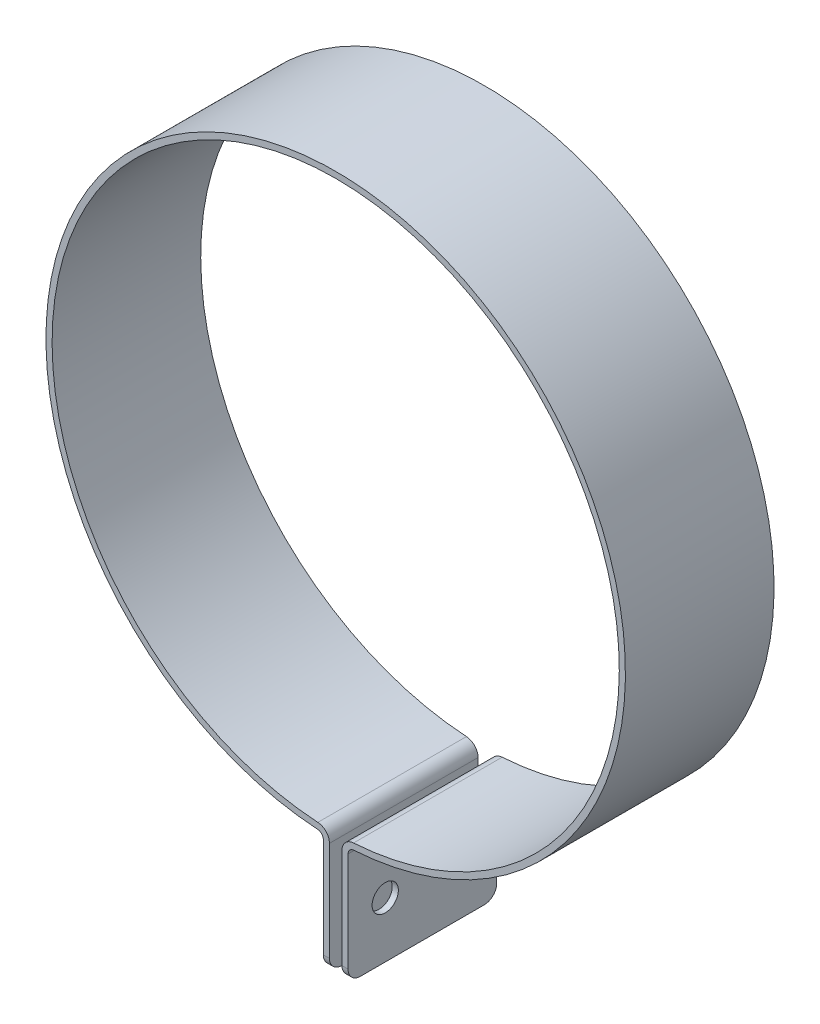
ISO-10303-21;
HEADER;
FILE_DESCRIPTION(('STEP AP214'),'2;1');
FILE_NAME('part.step','',(''),(''),'','','');
FILE_SCHEMA(('AUTOMOTIVE_DESIGN { 1 0 10303 214 1 1 1 1 }'));
ENDSEC;
DATA;
#1=APPLICATION_CONTEXT('core data for automotive mechanical design processes');
#2=APPLICATION_PROTOCOL_DEFINITION('international standard','automotive_design',2000,#1);
#3=PRODUCT_CONTEXT('',#1,'mechanical');
#4=PRODUCT('Part','Part','',(#3));
#5=PRODUCT_RELATED_PRODUCT_CATEGORY('part','',(#4));
#6=PRODUCT_DEFINITION_FORMATION('','',#4);
#7=PRODUCT_DEFINITION_CONTEXT('part definition',#1,'design');
#8=PRODUCT_DEFINITION('design','',#6,#7);
#9=PRODUCT_DEFINITION_SHAPE('','',#8);
#10=(LENGTH_UNIT() NAMED_UNIT(*) SI_UNIT(.MILLI.,.METRE.));
#11=(NAMED_UNIT(*) PLANE_ANGLE_UNIT() SI_UNIT($,.RADIAN.));
#12=(NAMED_UNIT(*) SI_UNIT($,.STERADIAN.) SOLID_ANGLE_UNIT());
#13=UNCERTAINTY_MEASURE_WITH_UNIT(LENGTH_MEASURE(1.E-05),#10,'distance_accuracy_value','');
#14=(GEOMETRIC_REPRESENTATION_CONTEXT(3) GLOBAL_UNCERTAINTY_ASSIGNED_CONTEXT((#13)) GLOBAL_UNIT_ASSIGNED_CONTEXT((#10,
#11,#12)) REPRESENTATION_CONTEXT('',''));
#15=CARTESIAN_POINT('',(0.,0.,0.));
#16=DIRECTION('',(0.,0.,1.));
#17=DIRECTION('',(1.,0.,0.));
#18=AXIS2_PLACEMENT_3D('',#15,#16,#17);
#19=CARTESIAN_POINT('',(-3.175,-104.4575,-38.1));
#20=DIRECTION('',(0.,-1.,0.));
#21=DIRECTION('',(0.,0.,-1.));
#22=AXIS2_PLACEMENT_3D('',#19,#20,#21);
#23=PLANE('',#22);
#24=DIRECTION('',(0.,0.,1.));
#25=VECTOR('',#24,1.);
#26=CARTESIAN_POINT('',(-3.175,-104.4575,-38.1));
#27=LINE('',#26,#25);
#28=CARTESIAN_POINT('',(-3.175,-104.4575,-34.925));
#29=VERTEX_POINT('',#28);
#30=CARTESIAN_POINT('',(-3.175,-104.4575,-3.17500000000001));
#31=VERTEX_POINT('',#30);
#32=EDGE_CURVE('E284',#29,#31,#27,.T.);
#33=ORIENTED_EDGE('',*,*,#32,.F.);
#34=DIRECTION('',(1.,0.,0.));
#35=VECTOR('',#34,1.);
#36=CARTESIAN_POINT('',(-1.6002,-104.4575,-34.925));
#37=LINE('',#36,#35);
#38=CARTESIAN_POINT('',(-1.6002,-104.4575,-34.925));
#39=VERTEX_POINT('',#38);
#40=EDGE_CURVE('E226',#29,#39,#37,.T.);
#41=ORIENTED_EDGE('',*,*,#40,.T.);
#42=DIRECTION('',(0.,0.,-1.));
#43=VECTOR('',#42,1.);
#44=CARTESIAN_POINT('',(-1.6002,-104.4575,-38.1));
#45=LINE('',#44,#43);
#46=CARTESIAN_POINT('',(-1.6002,-104.4575,-3.175));
#47=VERTEX_POINT('',#46);
#48=EDGE_CURVE('E183',#47,#39,#45,.T.);
#49=ORIENTED_EDGE('',*,*,#48,.F.);
#50=DIRECTION('',(1.,0.,0.));
#51=VECTOR('',#50,1.);
#52=CARTESIAN_POINT('',(-3.175,-104.4575,-3.175));
#53=LINE('',#52,#51);
#54=EDGE_CURVE('E224',#47,#31,#53,.F.);
#55=ORIENTED_EDGE('',*,*,#54,.T.);
#56=EDGE_LOOP('',(#33,#41,#49,#55));
#57=FACE_BOUND('',#56,.T.);
#58=ADVANCED_FACE('F37',(#57),#23,.T.);
#59=CARTESIAN_POINT('',(0.,0.,-38.1));
#60=DIRECTION('',(0.,0.,1.));
#61=DIRECTION('',(1.,0.,0.));
#62=AXIS2_PLACEMENT_3D('',#59,#60,#61);
#63=CYLINDRICAL_SURFACE('',#62,74.2823);
#64=CARTESIAN_POINT('',(0.,0.,-38.1));
#65=DIRECTION('',(0.,0.,1.));
#66=DIRECTION('',(1.,0.,0.));
#67=AXIS2_PLACEMENT_3D('',#64,#65,#66);
#68=CIRCLE('',#67,74.2823);
#69=CARTESIAN_POINT('',(4.65119373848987,-74.1365395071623,-38.1));
#70=VERTEX_POINT('',#69);
#71=CARTESIAN_POINT('',(-4.65119373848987,-74.1365395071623,-38.1));
#72=VERTEX_POINT('',#71);
#73=EDGE_CURVE('E296',#70,#72,#68,.T.);
#74=ORIENTED_EDGE('',*,*,#73,.T.);
#75=DIRECTION('',(0.,0.,1.));
#76=VECTOR('',#75,1.);
#77=CARTESIAN_POINT('',(-4.65119373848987,-74.1365395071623,-38.1));
#78=LINE('',#77,#76);
#79=CARTESIAN_POINT('',(-4.65119373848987,-74.1365395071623,0.));
#80=VERTEX_POINT('',#79);
#81=EDGE_CURVE('E185',#72,#80,#78,.T.);
#82=ORIENTED_EDGE('',*,*,#81,.T.);
#83=CARTESIAN_POINT('',(0.,0.,0.));
#84=DIRECTION('',(0.,0.,1.));
#85=DIRECTION('',(1.,0.,0.));
#86=AXIS2_PLACEMENT_3D('',#83,#84,#85);
#87=CIRCLE('',#86,74.2823);
#88=CARTESIAN_POINT('',(4.65119373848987,-74.1365395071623,0.));
#89=VERTEX_POINT('',#88);
#90=EDGE_CURVE('E162',#89,#80,#87,.T.);
#91=ORIENTED_EDGE('',*,*,#90,.F.);
#92=DIRECTION('',(0.,0.,1.));
#93=VECTOR('',#92,1.);
#94=CARTESIAN_POINT('',(4.65119373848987,-74.1365395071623,-38.1));
#95=LINE('',#94,#93);
#96=EDGE_CURVE('E182',#89,#70,#95,.F.);
#97=ORIENTED_EDGE('',*,*,#96,.T.);
#98=EDGE_LOOP('',(#74,#82,#91,#97));
#99=FACE_BOUND('',#98,.T.);
#100=ADVANCED_FACE('F325',(#99),#63,.T.);
#101=CARTESIAN_POINT('',(0.,0.,-38.1));
#102=DIRECTION('',(0.,0.,1.));
#103=DIRECTION('',(1.,0.,0.));
#104=AXIS2_PLACEMENT_3D('',#101,#102,#103);
#105=PLANE('',#104);
#106=DIRECTION('',(0.,1.,0.));
#107=VECTOR('',#106,1.);
#108=CARTESIAN_POINT('',(3.175,-104.4575,-38.1));
#109=LINE('',#108,#107);
#110=CARTESIAN_POINT('',(3.175,-101.2825,-38.1));
#111=VERTEX_POINT('',#110);
#112=CARTESIAN_POINT('',(3.175,-75.7082493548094,-38.1));
#113=VERTEX_POINT('',#112);
#114=EDGE_CURVE('E283',#111,#113,#109,.T.);
#115=ORIENTED_EDGE('',*,*,#114,.F.);
#116=DIRECTION('',(1.,0.,0.));
#117=VECTOR('',#116,1.);
#118=CARTESIAN_POINT('',(1.6002,-101.2825,-38.1));
#119=LINE('',#118,#117);
#120=CARTESIAN_POINT('',(1.6002,-101.2825,-38.1));
#121=VERTEX_POINT('',#120);
#122=EDGE_CURVE('E216',#111,#121,#119,.F.);
#123=ORIENTED_EDGE('',*,*,#122,.T.);
#124=DIRECTION('',(0.,1.,0.));
#125=VECTOR('',#124,1.);
#126=CARTESIAN_POINT('',(1.6002,-110.8075,-38.1));
#127=LINE('',#126,#125);
#128=CARTESIAN_POINT('',(1.6002,-75.7321019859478,-38.1));
#129=VERTEX_POINT('',#128);
#130=EDGE_CURVE('E179',#121,#129,#127,.T.);
#131=ORIENTED_EDGE('',*,*,#130,.T.);
#132=CARTESIAN_POINT('',(4.7752,-75.7321019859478,-38.1));
#133=DIRECTION('',(0.,0.,1.));
#134=DIRECTION('',(1.,0.,0.));
#135=AXIS2_PLACEMENT_3D('',#132,#133,#134);
#136=CIRCLE('',#135,3.175);
#137=CARTESIAN_POINT('',(4.57540083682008,-72.563394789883,-38.1));
#138=VERTEX_POINT('',#137);
#139=EDGE_CURVE('E210',#129,#138,#136,.F.);
#140=ORIENTED_EDGE('',*,*,#139,.T.);
#141=CARTESIAN_POINT('',(0.,0.,-38.1));
#142=DIRECTION('',(0.,0.,1.));
#143=DIRECTION('',(1.,0.,0.));
#144=AXIS2_PLACEMENT_3D('',#141,#142,#143);
#145=CIRCLE('',#144,72.7075);
#146=CARTESIAN_POINT('',(-4.57540083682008,-72.563394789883,-38.1));
#147=VERTEX_POINT('',#146);
#148=EDGE_CURVE('E292',#138,#147,#145,.T.);
#149=ORIENTED_EDGE('',*,*,#148,.T.);
#150=CARTESIAN_POINT('',(-4.7752,-75.7321019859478,-38.1));
#151=DIRECTION('',(0.,0.,1.));
#152=DIRECTION('',(1.,0.,0.));
#153=AXIS2_PLACEMENT_3D('',#150,#151,#152);
#154=CIRCLE('',#153,3.175);
#155=CARTESIAN_POINT('',(-1.6002,-75.7321019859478,-38.1));
#156=VERTEX_POINT('',#155);
#157=EDGE_CURVE('E212',#147,#156,#154,.F.);
#158=ORIENTED_EDGE('',*,*,#157,.T.);
#159=DIRECTION('',(0.,-1.,0.));
#160=VECTOR('',#159,1.);
#161=CARTESIAN_POINT('',(-1.6002,-110.8075,-38.1));
#162=LINE('',#161,#160);
#163=CARTESIAN_POINT('',(-1.6002,-101.2825,-38.1));
#164=VERTEX_POINT('',#163);
#165=EDGE_CURVE('E271',#156,#164,#162,.T.);
#166=ORIENTED_EDGE('',*,*,#165,.T.);
#167=DIRECTION('',(1.,0.,0.));
#168=VECTOR('',#167,1.);
#169=CARTESIAN_POINT('',(-3.175,-101.2825,-38.1));
#170=LINE('',#169,#168);
#171=CARTESIAN_POINT('',(-3.175,-101.2825,-38.1));
#172=VERTEX_POINT('',#171);
#173=EDGE_CURVE('E214',#164,#172,#170,.F.);
#174=ORIENTED_EDGE('',*,*,#173,.T.);
#175=DIRECTION('',(0.,-1.,0.));
#176=VECTOR('',#175,1.);
#177=CARTESIAN_POINT('',(-3.175,-104.4575,-38.1));
#178=LINE('',#177,#176);
#179=CARTESIAN_POINT('',(-3.175,-75.7082493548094,-38.1));
#180=VERTEX_POINT('',#179);
#181=EDGE_CURVE('E281',#180,#172,#178,.T.);
#182=ORIENTED_EDGE('',*,*,#181,.F.);
#183=CARTESIAN_POINT('',(-4.7498,-75.7082493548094,-38.1));
#184=DIRECTION('',(0.,0.,1.));
#185=DIRECTION('',(1.,0.,0.));
#186=AXIS2_PLACEMENT_3D('',#183,#184,#185);
#187=CIRCLE('',#186,1.5748);
#188=EDGE_CURVE('E167',#180,#72,#187,.T.);
#189=ORIENTED_EDGE('',*,*,#188,.T.);
#190=ORIENTED_EDGE('',*,*,#73,.F.);
#191=CARTESIAN_POINT('',(4.7498,-75.7082493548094,-38.1));
#192=DIRECTION('',(0.,0.,1.));
#193=DIRECTION('',(1.,0.,0.));
#194=AXIS2_PLACEMENT_3D('',#191,#192,#193);
#195=CIRCLE('',#194,1.5748);
#196=EDGE_CURVE('E198',#70,#113,#195,.T.);
#197=ORIENTED_EDGE('',*,*,#196,.T.);
#198=EDGE_LOOP('',(#115,#123,#131,#140,#149,#158,#166,#174,#182,#189,#190,#197));
#199=FACE_BOUND('',#198,.T.);
#200=ADVANCED_FACE('F328',(#199),#105,.F.);
#201=CARTESIAN_POINT('',(0.,0.,0.));
#202=DIRECTION('',(0.,0.,1.));
#203=DIRECTION('',(1.,0.,0.));
#204=AXIS2_PLACEMENT_3D('',#201,#202,#203);
#205=PLANE('',#204);
#206=DIRECTION('',(0.,-1.,0.));
#207=VECTOR('',#206,1.);
#208=CARTESIAN_POINT('',(-3.175,-104.4575,0.));
#209=LINE('',#208,#207);
#210=CARTESIAN_POINT('',(-3.175,-75.7082493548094,0.));
#211=VERTEX_POINT('',#210);
#212=CARTESIAN_POINT('',(-3.175,-101.2825,0.));
#213=VERTEX_POINT('',#212);
#214=EDGE_CURVE('E159',#211,#213,#209,.T.);
#215=ORIENTED_EDGE('',*,*,#214,.T.);
#216=DIRECTION('',(1.,0.,0.));
#217=VECTOR('',#216,1.);
#218=CARTESIAN_POINT('',(0.,-101.2825,0.));
#219=LINE('',#218,#217);
#220=CARTESIAN_POINT('',(-1.6002,-101.2825,0.));
#221=VERTEX_POINT('',#220);
#222=EDGE_CURVE('E243',#213,#221,#219,.T.);
#223=ORIENTED_EDGE('',*,*,#222,.T.);
#224=DIRECTION('',(0.,-1.,0.));
#225=VECTOR('',#224,1.);
#226=CARTESIAN_POINT('',(-1.6002,-110.8075,0.));
#227=LINE('',#226,#225);
#228=CARTESIAN_POINT('',(-1.6002,-75.7321019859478,0.));
#229=VERTEX_POINT('',#228);
#230=EDGE_CURVE('E270',#229,#221,#227,.T.);
#231=ORIENTED_EDGE('',*,*,#230,.F.);
#232=CARTESIAN_POINT('',(-4.7752,-75.7321019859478,0.));
#233=DIRECTION('',(0.,0.,1.));
#234=DIRECTION('',(1.,0.,0.));
#235=AXIS2_PLACEMENT_3D('',#232,#233,#234);
#236=CIRCLE('',#235,3.175);
#237=CARTESIAN_POINT('',(-4.57540083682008,-72.563394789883,0.));
#238=VERTEX_POINT('',#237);
#239=EDGE_CURVE('E54',#229,#238,#236,.T.);
#240=ORIENTED_EDGE('',*,*,#239,.T.);
#241=CARTESIAN_POINT('',(0.,0.,0.));
#242=DIRECTION('',(0.,0.,1.));
#243=DIRECTION('',(1.,0.,0.));
#244=AXIS2_PLACEMENT_3D('',#241,#242,#243);
#245=CIRCLE('',#244,72.7075);
#246=CARTESIAN_POINT('',(4.57540083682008,-72.563394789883,0.));
#247=VERTEX_POINT('',#246);
#248=EDGE_CURVE('E290',#247,#238,#245,.T.);
#249=ORIENTED_EDGE('',*,*,#248,.F.);
#250=CARTESIAN_POINT('',(4.7752,-75.7321019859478,0.));
#251=DIRECTION('',(0.,0.,1.));
#252=DIRECTION('',(1.,0.,0.));
#253=AXIS2_PLACEMENT_3D('',#250,#251,#252);
#254=CIRCLE('',#253,3.175);
#255=CARTESIAN_POINT('',(1.6002,-75.7321019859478,0.));
#256=VERTEX_POINT('',#255);
#257=EDGE_CURVE('E62',#247,#256,#254,.T.);
#258=ORIENTED_EDGE('',*,*,#257,.T.);
#259=DIRECTION('',(0.,1.,0.));
#260=VECTOR('',#259,1.);
#261=CARTESIAN_POINT('',(1.6002,-110.8075,0.));
#262=LINE('',#261,#260);
#263=CARTESIAN_POINT('',(1.6002,-101.2825,0.));
#264=VERTEX_POINT('',#263);
#265=EDGE_CURVE('E274',#264,#256,#262,.T.);
#266=ORIENTED_EDGE('',*,*,#265,.F.);
#267=DIRECTION('',(1.,0.,0.));
#268=VECTOR('',#267,1.);
#269=CARTESIAN_POINT('',(0.,-101.2825,0.));
#270=LINE('',#269,#268);
#271=CARTESIAN_POINT('',(3.175,-101.2825,0.));
#272=VERTEX_POINT('',#271);
#273=EDGE_CURVE('E240',#264,#272,#270,.T.);
#274=ORIENTED_EDGE('',*,*,#273,.T.);
#275=DIRECTION('',(0.,1.,0.));
#276=VECTOR('',#275,1.);
#277=CARTESIAN_POINT('',(3.175,-104.4575,0.));
#278=LINE('',#277,#276);
#279=CARTESIAN_POINT('',(3.175,-75.7082493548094,0.));
#280=VERTEX_POINT('',#279);
#281=EDGE_CURVE('E178',#272,#280,#278,.T.);
#282=ORIENTED_EDGE('',*,*,#281,.T.);
#283=CARTESIAN_POINT('',(4.7498,-75.7082493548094,0.));
#284=DIRECTION('',(0.,0.,1.));
#285=DIRECTION('',(1.,0.,0.));
#286=AXIS2_PLACEMENT_3D('',#283,#284,#285);
#287=CIRCLE('',#286,1.5748);
#288=EDGE_CURVE('E166',#280,#89,#287,.F.);
#289=ORIENTED_EDGE('',*,*,#288,.T.);
#290=ORIENTED_EDGE('',*,*,#90,.T.);
#291=CARTESIAN_POINT('',(-4.7498,-75.7082493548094,0.));
#292=DIRECTION('',(0.,0.,1.));
#293=DIRECTION('',(1.,0.,0.));
#294=AXIS2_PLACEMENT_3D('',#291,#292,#293);
#295=CIRCLE('',#294,1.5748);
#296=EDGE_CURVE('E155',#80,#211,#295,.F.);
#297=ORIENTED_EDGE('',*,*,#296,.T.);
#298=EDGE_LOOP('',(#215,#223,#231,#240,#249,#258,#266,#274,#282,#289,#290,#297));
#299=FACE_BOUND('',#298,.T.);
#300=ADVANCED_FACE('F157',(#299),#205,.T.);
#301=CARTESIAN_POINT('',(0.,0.,-38.1));
#302=DIRECTION('',(0.,0.,1.));
#303=DIRECTION('',(1.,0.,0.));
#304=AXIS2_PLACEMENT_3D('',#301,#302,#303);
#305=CYLINDRICAL_SURFACE('',#304,72.7075);
#306=ORIENTED_EDGE('',*,*,#248,.T.);
#307=DIRECTION('',(0.,0.,1.));
#308=VECTOR('',#307,1.);
#309=CARTESIAN_POINT('',(-4.57540083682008,-72.563394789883,-38.1));
#310=LINE('',#309,#308);
#311=EDGE_CURVE('E11',#238,#147,#310,.F.);
#312=ORIENTED_EDGE('',*,*,#311,.T.);
#313=ORIENTED_EDGE('',*,*,#148,.F.);
#314=DIRECTION('',(0.,0.,1.));
#315=VECTOR('',#314,1.);
#316=CARTESIAN_POINT('',(4.57540083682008,-72.563394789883,-38.1));
#317=LINE('',#316,#315);
#318=EDGE_CURVE('E46',#138,#247,#317,.T.);
#319=ORIENTED_EDGE('',*,*,#318,.T.);
#320=EDGE_LOOP('',(#306,#312,#313,#319));
#321=FACE_BOUND('',#320,.T.);
#322=ADVANCED_FACE('F349',(#321),#305,.F.);
#323=CARTESIAN_POINT('',(-3.175,-104.4575,-38.1));
#324=DIRECTION('',(-1.,0.,0.));
#325=DIRECTION('',(0.,0.,1.));
#326=AXIS2_PLACEMENT_3D('',#323,#324,#325);
#327=PLANE('',#326);
#328=CARTESIAN_POINT('',(-3.175,-90.1827,-9.525));
#329=DIRECTION('',(-1.,0.,0.));
#330=DIRECTION('',(0.,0.,1.));
#331=AXIS2_PLACEMENT_3D('',#328,#329,#330);
#332=CIRCLE('',#331,3.36549999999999);
#333=CARTESIAN_POINT('',(-3.17499999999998,-90.1827,-12.8905));
#334=VERTEX_POINT('',#333);
#335=EDGE_CURVE('E267',#334,#334,#332,.T.);
#336=ORIENTED_EDGE('',*,*,#335,.F.);
#337=EDGE_LOOP('',(#336));
#338=FACE_BOUND('',#337,.T.);
#339=CARTESIAN_POINT('',(-3.175,-90.1827,-28.575));
#340=DIRECTION('',(-1.,0.,0.));
#341=DIRECTION('',(0.,0.,1.));
#342=AXIS2_PLACEMENT_3D('',#339,#340,#341);
#343=CIRCLE('',#342,3.36549999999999);
#344=CARTESIAN_POINT('',(-3.17499999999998,-90.1827,-31.9405));
#345=VERTEX_POINT('',#344);
#346=EDGE_CURVE('E252',#345,#345,#343,.T.);
#347=ORIENTED_EDGE('',*,*,#346,.F.);
#348=EDGE_LOOP('',(#347));
#349=FACE_BOUND('',#348,.T.);
#350=ORIENTED_EDGE('',*,*,#181,.T.);
#351=CARTESIAN_POINT('',(-3.175,-101.2825,-34.925));
#352=DIRECTION('',(-1.,0.,0.));
#353=DIRECTION('',(0.,0.,1.));
#354=AXIS2_PLACEMENT_3D('',#351,#352,#353);
#355=CIRCLE('',#354,3.175);
#356=EDGE_CURVE('E236',#172,#29,#355,.T.);
#357=ORIENTED_EDGE('',*,*,#356,.T.);
#358=ORIENTED_EDGE('',*,*,#32,.T.);
#359=CARTESIAN_POINT('',(-3.175,-101.2825,-3.175));
#360=DIRECTION('',(-1.,0.,0.));
#361=DIRECTION('',(0.,0.,1.));
#362=AXIS2_PLACEMENT_3D('',#359,#360,#361);
#363=CIRCLE('',#362,3.175);
#364=EDGE_CURVE('E177',#31,#213,#363,.T.);
#365=ORIENTED_EDGE('',*,*,#364,.T.);
#366=ORIENTED_EDGE('',*,*,#214,.F.);
#367=DIRECTION('',(0.,0.,-1.));
#368=VECTOR('',#367,1.);
#369=CARTESIAN_POINT('',(-3.175,-75.7082493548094,-38.1));
#370=LINE('',#369,#368);
#371=EDGE_CURVE('E173',#211,#180,#370,.T.);
#372=ORIENTED_EDGE('',*,*,#371,.T.);
#373=EDGE_LOOP('',(#350,#357,#358,#365,#366,#372));
#374=FACE_BOUND('',#373,.T.);
#375=ADVANCED_FACE('F172',(#338,#349,#374),#327,.T.);
#376=CARTESIAN_POINT('',(3.175,-104.4575,-38.1));
#377=DIRECTION('',(1.,0.,0.));
#378=DIRECTION('',(0.,0.,-1.));
#379=AXIS2_PLACEMENT_3D('',#376,#377,#378);
#380=PLANE('',#379);
#381=CARTESIAN_POINT('',(3.175,-90.1827,-9.525));
#382=DIRECTION('',(1.,0.,0.));
#383=DIRECTION('',(0.,0.,-1.));
#384=AXIS2_PLACEMENT_3D('',#381,#382,#383);
#385=CIRCLE('',#384,3.36549999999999);
#386=CARTESIAN_POINT('',(3.175,-90.1827,-12.8905));
#387=VERTEX_POINT('',#386);
#388=EDGE_CURVE('E248',#387,#387,#385,.T.);
#389=ORIENTED_EDGE('',*,*,#388,.F.);
#390=EDGE_LOOP('',(#389));
#391=FACE_BOUND('',#390,.T.);
#392=CARTESIAN_POINT('',(3.175,-90.1827,-28.575));
#393=DIRECTION('',(1.,0.,0.));
#394=DIRECTION('',(0.,0.,-1.));
#395=AXIS2_PLACEMENT_3D('',#392,#393,#394);
#396=CIRCLE('',#395,3.36549999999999);
#397=CARTESIAN_POINT('',(3.175,-90.1827,-31.9405));
#398=VERTEX_POINT('',#397);
#399=EDGE_CURVE('E255',#398,#398,#396,.T.);
#400=ORIENTED_EDGE('',*,*,#399,.F.);
#401=EDGE_LOOP('',(#400));
#402=FACE_BOUND('',#401,.T.);
#403=DIRECTION('',(0.,0.,1.));
#404=VECTOR('',#403,1.);
#405=CARTESIAN_POINT('',(3.175,-104.4575,-38.1));
#406=LINE('',#405,#404);
#407=CARTESIAN_POINT('',(3.175,-104.4575,-34.925));
#408=VERTEX_POINT('',#407);
#409=CARTESIAN_POINT('',(3.175,-104.4575,-3.17500000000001));
#410=VERTEX_POINT('',#409);
#411=EDGE_CURVE('E287',#408,#410,#406,.T.);
#412=ORIENTED_EDGE('',*,*,#411,.F.);
#413=CARTESIAN_POINT('',(3.175,-101.2825,-34.925));
#414=DIRECTION('',(1.,0.,0.));
#415=DIRECTION('',(0.,0.,-1.));
#416=AXIS2_PLACEMENT_3D('',#413,#414,#415);
#417=CIRCLE('',#416,3.175);
#418=EDGE_CURVE('E208',#408,#111,#417,.T.);
#419=ORIENTED_EDGE('',*,*,#418,.T.);
#420=ORIENTED_EDGE('',*,*,#114,.T.);
#421=DIRECTION('',(0.,0.,-1.));
#422=VECTOR('',#421,1.);
#423=CARTESIAN_POINT('',(3.175,-75.7082493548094,0.));
#424=LINE('',#423,#422);
#425=EDGE_CURVE('E193',#113,#280,#424,.F.);
#426=ORIENTED_EDGE('',*,*,#425,.T.);
#427=ORIENTED_EDGE('',*,*,#281,.F.);
#428=CARTESIAN_POINT('',(3.175,-101.2825,-3.175));
#429=DIRECTION('',(1.,0.,0.));
#430=DIRECTION('',(0.,0.,-1.));
#431=AXIS2_PLACEMENT_3D('',#428,#429,#430);
#432=CIRCLE('',#431,3.175);
#433=EDGE_CURVE('E206',#272,#410,#432,.T.);
#434=ORIENTED_EDGE('',*,*,#433,.T.);
#435=EDGE_LOOP('',(#412,#419,#420,#426,#427,#434));
#436=FACE_BOUND('',#435,.T.);
#437=ADVANCED_FACE('F317',(#391,#402,#436),#380,.T.);
#438=DIRECTION('',(0.,0.,1.));
#439=VECTOR('',#438,1.);
#440=CARTESIAN_POINT('',(1.6002,-104.4575,-38.1));
#441=LINE('',#440,#439);
#442=CARTESIAN_POINT('',(1.6002,-104.4575,-34.925));
#443=VERTEX_POINT('',#442);
#444=CARTESIAN_POINT('',(1.6002,-104.4575,-3.175));
#445=VERTEX_POINT('',#444);
#446=EDGE_CURVE('E188',#443,#445,#441,.T.);
#447=ORIENTED_EDGE('',*,*,#446,.F.);
#448=DIRECTION('',(1.,0.,0.));
#449=VECTOR('',#448,1.);
#450=CARTESIAN_POINT('',(3.175,-104.4575,-34.925));
#451=LINE('',#450,#449);
#452=EDGE_CURVE('E203',#443,#408,#451,.T.);
#453=ORIENTED_EDGE('',*,*,#452,.T.);
#454=ORIENTED_EDGE('',*,*,#411,.T.);
#455=DIRECTION('',(1.,0.,0.));
#456=VECTOR('',#455,1.);
#457=CARTESIAN_POINT('',(-3.175,-104.4575,-3.175));
#458=LINE('',#457,#456);
#459=EDGE_CURVE('E201',#410,#445,#458,.F.);
#460=ORIENTED_EDGE('',*,*,#459,.T.);
#461=EDGE_LOOP('',(#447,#453,#454,#460));
#462=FACE_BOUND('',#461,.T.);
#463=ADVANCED_FACE('F354',(#462),#23,.T.);
#464=CARTESIAN_POINT('',(1.6002,-110.8075,-38.1));
#465=DIRECTION('',(1.,0.,0.));
#466=DIRECTION('',(0.,0.,-1.));
#467=AXIS2_PLACEMENT_3D('',#464,#465,#466);
#468=PLANE('',#467);
#469=CARTESIAN_POINT('',(1.6002,-90.1827,-9.525));
#470=DIRECTION('',(1.,0.,0.));
#471=DIRECTION('',(0.,0.,-1.));
#472=AXIS2_PLACEMENT_3D('',#469,#470,#471);
#473=CIRCLE('',#472,3.36549999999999);
#474=CARTESIAN_POINT('',(1.6002,-90.1827,-12.8905));
#475=VERTEX_POINT('',#474);
#476=EDGE_CURVE('E264',#475,#475,#473,.T.);
#477=ORIENTED_EDGE('',*,*,#476,.T.);
#478=EDGE_LOOP('',(#477));
#479=FACE_BOUND('',#478,.T.);
#480=CARTESIAN_POINT('',(1.6002,-90.1827,-28.575));
#481=DIRECTION('',(1.,0.,0.));
#482=DIRECTION('',(0.,0.,-1.));
#483=AXIS2_PLACEMENT_3D('',#480,#481,#482);
#484=CIRCLE('',#483,3.36549999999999);
#485=CARTESIAN_POINT('',(1.6002,-90.1827,-31.9405));
#486=VERTEX_POINT('',#485);
#487=EDGE_CURVE('E247',#486,#486,#484,.T.);
#488=ORIENTED_EDGE('',*,*,#487,.T.);
#489=EDGE_LOOP('',(#488));
#490=FACE_BOUND('',#489,.T.);
#491=ORIENTED_EDGE('',*,*,#130,.F.);
#492=CARTESIAN_POINT('',(1.6002,-101.2825,-34.925));
#493=DIRECTION('',(1.,0.,0.));
#494=DIRECTION('',(0.,0.,-1.));
#495=AXIS2_PLACEMENT_3D('',#492,#493,#494);
#496=CIRCLE('',#495,3.175);
#497=EDGE_CURVE('E222',#121,#443,#496,.F.);
#498=ORIENTED_EDGE('',*,*,#497,.T.);
#499=ORIENTED_EDGE('',*,*,#446,.T.);
#500=CARTESIAN_POINT('',(1.6002,-101.2825,-3.175));
#501=DIRECTION('',(1.,0.,0.));
#502=DIRECTION('',(0.,0.,-1.));
#503=AXIS2_PLACEMENT_3D('',#500,#501,#502);
#504=CIRCLE('',#503,3.175);
#505=EDGE_CURVE('E220',#445,#264,#504,.F.);
#506=ORIENTED_EDGE('',*,*,#505,.T.);
#507=ORIENTED_EDGE('',*,*,#265,.T.);
#508=DIRECTION('',(0.,0.,1.));
#509=VECTOR('',#508,1.);
#510=CARTESIAN_POINT('',(1.6002,-75.7321019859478,-38.1));
#511=LINE('',#510,#509);
#512=EDGE_CURVE('E218',#256,#129,#511,.F.);
#513=ORIENTED_EDGE('',*,*,#512,.T.);
#514=EDGE_LOOP('',(#491,#498,#499,#506,#507,#513));
#515=FACE_BOUND('',#514,.T.);
#516=ADVANCED_FACE('F304',(#479,#490,#515),#468,.F.);
#517=CARTESIAN_POINT('',(-1.6002,-110.8075,-38.1));
#518=DIRECTION('',(-1.,0.,0.));
#519=DIRECTION('',(0.,0.,1.));
#520=AXIS2_PLACEMENT_3D('',#517,#518,#519);
#521=PLANE('',#520);
#522=CARTESIAN_POINT('',(-1.6002,-90.1827,-9.525));
#523=DIRECTION('',(-1.,0.,0.));
#524=DIRECTION('',(0.,0.,1.));
#525=AXIS2_PLACEMENT_3D('',#522,#523,#524);
#526=CIRCLE('',#525,3.36549999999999);
#527=CARTESIAN_POINT('',(-1.6002,-90.1827,-12.8905));
#528=VERTEX_POINT('',#527);
#529=EDGE_CURVE('E41',#528,#528,#526,.T.);
#530=ORIENTED_EDGE('',*,*,#529,.T.);
#531=EDGE_LOOP('',(#530));
#532=FACE_BOUND('',#531,.T.);
#533=CARTESIAN_POINT('',(-1.6002,-90.1827,-28.575));
#534=DIRECTION('',(-1.,0.,0.));
#535=DIRECTION('',(0.,0.,1.));
#536=AXIS2_PLACEMENT_3D('',#533,#534,#535);
#537=CIRCLE('',#536,3.36549999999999);
#538=CARTESIAN_POINT('',(-1.6002,-90.1827,-31.9405));
#539=VERTEX_POINT('',#538);
#540=EDGE_CURVE('E245',#539,#539,#537,.T.);
#541=ORIENTED_EDGE('',*,*,#540,.T.);
#542=EDGE_LOOP('',(#541));
#543=FACE_BOUND('',#542,.T.);
#544=ORIENTED_EDGE('',*,*,#48,.T.);
#545=CARTESIAN_POINT('',(-1.6002,-101.2825,-34.925));
#546=DIRECTION('',(-1.,0.,0.));
#547=DIRECTION('',(0.,0.,1.));
#548=AXIS2_PLACEMENT_3D('',#545,#546,#547);
#549=CIRCLE('',#548,3.175);
#550=EDGE_CURVE('E233',#39,#164,#549,.F.);
#551=ORIENTED_EDGE('',*,*,#550,.T.);
#552=ORIENTED_EDGE('',*,*,#165,.F.);
#553=DIRECTION('',(0.,0.,1.));
#554=VECTOR('',#553,1.);
#555=CARTESIAN_POINT('',(-1.6002,-75.7321019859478,-38.1));
#556=LINE('',#555,#554);
#557=EDGE_CURVE('E229',#156,#229,#556,.T.);
#558=ORIENTED_EDGE('',*,*,#557,.T.);
#559=ORIENTED_EDGE('',*,*,#230,.T.);
#560=CARTESIAN_POINT('',(-1.6002,-101.2825,-3.175));
#561=DIRECTION('',(-1.,0.,0.));
#562=DIRECTION('',(0.,0.,1.));
#563=AXIS2_PLACEMENT_3D('',#560,#561,#562);
#564=CIRCLE('',#563,3.175);
#565=EDGE_CURVE('E231',#221,#47,#564,.F.);
#566=ORIENTED_EDGE('',*,*,#565,.T.);
#567=EDGE_LOOP('',(#544,#551,#552,#558,#559,#566));
#568=FACE_BOUND('',#567,.T.);
#569=ADVANCED_FACE('F339',(#532,#543,#568),#521,.F.);
#570=CARTESIAN_POINT('',(-4.7498,-75.7082493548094,-38.1));
#571=DIRECTION('',(0.,0.,1.));
#572=DIRECTION('',(1.,0.,0.));
#573=AXIS2_PLACEMENT_3D('',#570,#571,#572);
#574=CYLINDRICAL_SURFACE('',#573,1.5748);
#575=ORIENTED_EDGE('',*,*,#296,.F.);
#576=ORIENTED_EDGE('',*,*,#81,.F.);
#577=ORIENTED_EDGE('',*,*,#188,.F.);
#578=ORIENTED_EDGE('',*,*,#371,.F.);
#579=EDGE_LOOP('',(#575,#576,#577,#578));
#580=FACE_BOUND('',#579,.T.);
#581=ADVANCED_FACE('F181',(#580),#574,.F.);
#582=CARTESIAN_POINT('',(4.7498,-75.7082493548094,-38.1));
#583=DIRECTION('',(0.,0.,1.));
#584=DIRECTION('',(1.,0.,0.));
#585=AXIS2_PLACEMENT_3D('',#582,#583,#584);
#586=CYLINDRICAL_SURFACE('',#585,1.5748);
#587=ORIENTED_EDGE('',*,*,#196,.F.);
#588=ORIENTED_EDGE('',*,*,#96,.F.);
#589=ORIENTED_EDGE('',*,*,#288,.F.);
#590=ORIENTED_EDGE('',*,*,#425,.F.);
#591=EDGE_LOOP('',(#587,#588,#589,#590));
#592=FACE_BOUND('',#591,.T.);
#593=ADVANCED_FACE('F322',(#592),#586,.F.);
#594=CARTESIAN_POINT('',(-3.175,-101.2825,-34.925));
#595=DIRECTION('',(-1.,0.,0.));
#596=DIRECTION('',(0.,0.,1.));
#597=AXIS2_PLACEMENT_3D('',#594,#595,#596);
#598=CYLINDRICAL_SURFACE('',#597,3.175);
#599=ORIENTED_EDGE('',*,*,#497,.F.);
#600=ORIENTED_EDGE('',*,*,#122,.F.);
#601=ORIENTED_EDGE('',*,*,#418,.F.);
#602=ORIENTED_EDGE('',*,*,#452,.F.);
#603=EDGE_LOOP('',(#599,#600,#601,#602));
#604=FACE_BOUND('',#603,.T.);
#605=ADVANCED_FACE('F353',(#604),#598,.T.);
#606=CARTESIAN_POINT('',(-3.175,-101.2825,-34.925));
#607=DIRECTION('',(-1.,0.,0.));
#608=DIRECTION('',(0.,0.,1.));
#609=AXIS2_PLACEMENT_3D('',#606,#607,#608);
#610=CYLINDRICAL_SURFACE('',#609,3.175);
#611=ORIENTED_EDGE('',*,*,#356,.F.);
#612=ORIENTED_EDGE('',*,*,#173,.F.);
#613=ORIENTED_EDGE('',*,*,#550,.F.);
#614=ORIENTED_EDGE('',*,*,#40,.F.);
#615=EDGE_LOOP('',(#611,#612,#613,#614));
#616=FACE_BOUND('',#615,.T.);
#617=ADVANCED_FACE('F334',(#616),#610,.T.);
#618=CARTESIAN_POINT('',(0.,-101.2825,-3.175));
#619=DIRECTION('',(1.,0.,0.));
#620=DIRECTION('',(0.,0.,-1.));
#621=AXIS2_PLACEMENT_3D('',#618,#619,#620);
#622=CYLINDRICAL_SURFACE('',#621,3.175);
#623=ORIENTED_EDGE('',*,*,#364,.F.);
#624=ORIENTED_EDGE('',*,*,#54,.F.);
#625=ORIENTED_EDGE('',*,*,#565,.F.);
#626=ORIENTED_EDGE('',*,*,#222,.F.);
#627=EDGE_LOOP('',(#623,#624,#625,#626));
#628=FACE_BOUND('',#627,.T.);
#629=ADVANCED_FACE('F342',(#628),#622,.T.);
#630=CARTESIAN_POINT('',(0.,-101.2825,-3.175));
#631=DIRECTION('',(1.,0.,0.));
#632=DIRECTION('',(0.,0.,-1.));
#633=AXIS2_PLACEMENT_3D('',#630,#631,#632);
#634=CYLINDRICAL_SURFACE('',#633,3.175);
#635=ORIENTED_EDGE('',*,*,#505,.F.);
#636=ORIENTED_EDGE('',*,*,#459,.F.);
#637=ORIENTED_EDGE('',*,*,#433,.F.);
#638=ORIENTED_EDGE('',*,*,#273,.F.);
#639=EDGE_LOOP('',(#635,#636,#637,#638));
#640=FACE_BOUND('',#639,.T.);
#641=ADVANCED_FACE('F312',(#640),#634,.T.);
#642=CARTESIAN_POINT('',(-4.7752,-75.7321019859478,-38.1));
#643=DIRECTION('',(0.,0.,1.));
#644=DIRECTION('',(1.,0.,0.));
#645=AXIS2_PLACEMENT_3D('',#642,#643,#644);
#646=CYLINDRICAL_SURFACE('',#645,3.175);
#647=ORIENTED_EDGE('',*,*,#239,.F.);
#648=ORIENTED_EDGE('',*,*,#557,.F.);
#649=ORIENTED_EDGE('',*,*,#157,.F.);
#650=ORIENTED_EDGE('',*,*,#311,.F.);
#651=EDGE_LOOP('',(#647,#648,#649,#650));
#652=FACE_BOUND('',#651,.T.);
#653=ADVANCED_FACE('F346',(#652),#646,.T.);
#654=CARTESIAN_POINT('',(4.7752,-75.7321019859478,-38.1));
#655=DIRECTION('',(0.,0.,1.));
#656=DIRECTION('',(1.,0.,0.));
#657=AXIS2_PLACEMENT_3D('',#654,#655,#656);
#658=CYLINDRICAL_SURFACE('',#657,3.175);
#659=ORIENTED_EDGE('',*,*,#139,.F.);
#660=ORIENTED_EDGE('',*,*,#512,.F.);
#661=ORIENTED_EDGE('',*,*,#257,.F.);
#662=ORIENTED_EDGE('',*,*,#318,.F.);
#663=EDGE_LOOP('',(#659,#660,#661,#662));
#664=FACE_BOUND('',#663,.T.);
#665=ADVANCED_FACE('F39',(#664),#658,.T.);
#666=CARTESIAN_POINT('',(-74.2823,-90.1827,-28.575));
#667=DIRECTION('',(1.,0.,0.));
#668=DIRECTION('',(0.,0.,-1.));
#669=AXIS2_PLACEMENT_3D('',#666,#667,#668);
#670=CYLINDRICAL_SURFACE('',#669,3.36549999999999);
#671=CARTESIAN_POINT('',(-3.17499999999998,-90.1827,-31.9405));
#672=CARTESIAN_POINT('',(-3.15859583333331,-90.1827,-31.9405));
#673=CARTESIAN_POINT('',(-3.14219166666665,-90.1827,-31.9405));
#674=CARTESIAN_POINT('',(-3.10938333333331,-90.1827,-31.9405));
#675=CARTESIAN_POINT('',(-3.09297916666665,-90.1827,-31.9405));
#676=CARTESIAN_POINT('',(-3.06017083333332,-90.1827,-31.9405));
#677=CARTESIAN_POINT('',(-3.04376666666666,-90.1827,-31.9405));
#678=CARTESIAN_POINT('',(-3.01095833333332,-90.1827,-31.9405));
#679=CARTESIAN_POINT('',(-2.99455416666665,-90.1827,-31.9405));
#680=CARTESIAN_POINT('',(-2.96174583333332,-90.1827,-31.9405));
#681=CARTESIAN_POINT('',(-2.94534166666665,-90.1827,-31.9405));
#682=CARTESIAN_POINT('',(-2.91253333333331,-90.1827,-31.9405));
#683=CARTESIAN_POINT('',(-2.89612916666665,-90.1827,-31.9405));
#684=CARTESIAN_POINT('',(-2.86332083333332,-90.1827,-31.9405));
#685=CARTESIAN_POINT('',(-2.84691666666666,-90.1827,-31.9405));
#686=CARTESIAN_POINT('',(-2.81410833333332,-90.1827,-31.9405));
#687=CARTESIAN_POINT('',(-2.79770416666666,-90.1827,-31.9405));
#688=CARTESIAN_POINT('',(-2.76489583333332,-90.1827,-31.9405));
#689=CARTESIAN_POINT('',(-2.74849166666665,-90.1827,-31.9405));
#690=CARTESIAN_POINT('',(-2.71568333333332,-90.1827,-31.9405));
#691=CARTESIAN_POINT('',(-2.69927916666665,-90.1827,-31.9405));
#692=CARTESIAN_POINT('',(-2.66647083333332,-90.1827,-31.9405));
#693=CARTESIAN_POINT('',(-2.65006666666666,-90.1827,-31.9405));
#694=CARTESIAN_POINT('',(-2.61725833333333,-90.1827,-31.9405));
#695=CARTESIAN_POINT('',(-2.60085416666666,-90.1827,-31.9405));
#696=CARTESIAN_POINT('',(-2.56804583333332,-90.1827,-31.9405));
#697=CARTESIAN_POINT('',(-2.55164166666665,-90.1827,-31.9405));
#698=CARTESIAN_POINT('',(-2.51883333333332,-90.1827,-31.9405));
#699=CARTESIAN_POINT('',(-2.50242916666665,-90.1827,-31.9405));
#700=CARTESIAN_POINT('',(-2.46962083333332,-90.1827,-31.9405));
#701=CARTESIAN_POINT('',(-2.45321666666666,-90.1827,-31.9405));
#702=CARTESIAN_POINT('',(-2.42040833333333,-90.1827,-31.9405));
#703=CARTESIAN_POINT('',(-2.40400416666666,-90.1827,-31.9405));
#704=CARTESIAN_POINT('',(-2.37119583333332,-90.1827,-31.9405));
#705=CARTESIAN_POINT('',(-2.35479166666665,-90.1827,-31.9405));
#706=CARTESIAN_POINT('',(-2.32198333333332,-90.1827,-31.9405));
#707=CARTESIAN_POINT('',(-2.30557916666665,-90.1827,-31.9405));
#708=CARTESIAN_POINT('',(-2.27277083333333,-90.1827,-31.9405));
#709=CARTESIAN_POINT('',(-2.25636666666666,-90.1827,-31.9405));
#710=CARTESIAN_POINT('',(-2.22355833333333,-90.1827,-31.9405));
#711=CARTESIAN_POINT('',(-2.20715416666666,-90.1827,-31.9405));
#712=CARTESIAN_POINT('',(-2.17434583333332,-90.1827,-31.9405));
#713=CARTESIAN_POINT('',(-2.15794166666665,-90.1827,-31.9405));
#714=CARTESIAN_POINT('',(-2.12513333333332,-90.1827,-31.9405));
#715=CARTESIAN_POINT('',(-2.10872916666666,-90.1827,-31.9405));
#716=CARTESIAN_POINT('',(-2.07592083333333,-90.1827,-31.9405));
#717=CARTESIAN_POINT('',(-2.05951666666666,-90.1827,-31.9405));
#718=CARTESIAN_POINT('',(-2.02670833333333,-90.1827,-31.9405));
#719=CARTESIAN_POINT('',(-2.01030416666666,-90.1827,-31.9405));
#720=CARTESIAN_POINT('',(-1.97749583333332,-90.1827,-31.9405));
#721=CARTESIAN_POINT('',(-1.96109166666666,-90.1827,-31.9405));
#722=CARTESIAN_POINT('',(-1.92828333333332,-90.1827,-31.9405));
#723=CARTESIAN_POINT('',(-1.91187916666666,-90.1827,-31.9405));
#724=CARTESIAN_POINT('',(-1.87907083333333,-90.1827,-31.9405));
#725=CARTESIAN_POINT('',(-1.86266666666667,-90.1827,-31.9405));
#726=CARTESIAN_POINT('',(-1.82985833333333,-90.1827,-31.9405));
#727=CARTESIAN_POINT('',(-1.81345416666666,-90.1827,-31.9405));
#728=CARTESIAN_POINT('',(-1.78064583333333,-90.1827,-31.9405));
#729=CARTESIAN_POINT('',(-1.76424166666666,-90.1827,-31.9405));
#730=CARTESIAN_POINT('',(-1.73143333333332,-90.1827,-31.9405));
#731=CARTESIAN_POINT('',(-1.71502916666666,-90.1827,-31.9405));
#732=CARTESIAN_POINT('',(-1.68222083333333,-90.1827,-31.9405));
#733=CARTESIAN_POINT('',(-1.66581666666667,-90.1827,-31.9405));
#734=CARTESIAN_POINT('',(-1.63300833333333,-90.1827,-31.9405));
#735=CARTESIAN_POINT('',(-1.61660416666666,-90.1827,-31.9405));
#736=CARTESIAN_POINT('',(-1.6002,-90.1827,-31.9405));
#737=B_SPLINE_CURVE_WITH_KNOTS('',3,(#671,#672,#673,#674,#675,#676,#677,#678,#679,#680,#681,
#682,#683,#684,#685,#686,#687,#688,#689,#690,#691,#692,#693,#694,#695,#696,#697,#698,#699,#700,
#701,#702,#703,#704,#705,#706,#707,#708,#709,#710,#711,#712,#713,#714,#715,#716,#717,#718,#719,
#720,#721,#722,#723,#724,#725,#726,#727,#728,#729,#730,#731,#732,#733,#734,#735,#736),
.UNSPECIFIED.,.F.,.F.,(4,2,2,2,2,2,2,2,2,2,2,2,2,2,2,2,2,2,2,2,2,2,2,2,2,2,2,2,2,2,2,2,4),(0.,
0.0492125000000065,0.0984249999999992,0.147637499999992,0.196849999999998,0.246062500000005,
0.295274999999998,0.34448749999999,0.393699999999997,0.442912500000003,0.492124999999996,
0.541337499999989,0.590549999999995,0.639762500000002,0.688974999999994,0.738187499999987,
0.787399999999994,0.8366125,0.885824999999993,0.935037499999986,0.984249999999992,1.0334625,
1.08267499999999,1.13188749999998,1.18109999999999,1.2303125,1.27952499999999,1.32873749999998,
1.37794999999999,1.4271625,1.47637499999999,1.52558749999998,1.57479999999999),.UNSPECIFIED.);
#738=EDGE_CURVE('BSEAM392',#345,#539,#737,.T.);
#739=ORIENTED_EDGE('',*,*,#346,.T.);
#740=ORIENTED_EDGE('',*,*,#540,.F.);
#741=ORIENTED_EDGE('',*,*,#738,.T.);
#742=ORIENTED_EDGE('',*,*,#738,.F.);
#743=EDGE_LOOP('',(#739,#741,#740,#742));
#744=FACE_BOUND('',#743,.T.);
#745=ADVANCED_FACE('F392',(#744),#670,.F.);
#746=CARTESIAN_POINT('',(-74.2823,-90.1827,-9.525));
#747=DIRECTION('',(1.,0.,0.));
#748=DIRECTION('',(0.,0.,-1.));
#749=AXIS2_PLACEMENT_3D('',#746,#747,#748);
#750=CYLINDRICAL_SURFACE('',#749,3.36549999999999);
#751=CARTESIAN_POINT('',(-3.17499999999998,-90.1827,-12.8905));
#752=CARTESIAN_POINT('',(-3.15859583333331,-90.1827,-12.8905));
#753=CARTESIAN_POINT('',(-3.14219166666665,-90.1827,-12.8905));
#754=CARTESIAN_POINT('',(-3.10938333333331,-90.1827,-12.8905));
#755=CARTESIAN_POINT('',(-3.09297916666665,-90.1827,-12.8905));
#756=CARTESIAN_POINT('',(-3.06017083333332,-90.1827,-12.8905));
#757=CARTESIAN_POINT('',(-3.04376666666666,-90.1827,-12.8905));
#758=CARTESIAN_POINT('',(-3.01095833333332,-90.1827,-12.8905));
#759=CARTESIAN_POINT('',(-2.99455416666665,-90.1827,-12.8905));
#760=CARTESIAN_POINT('',(-2.96174583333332,-90.1827,-12.8905));
#761=CARTESIAN_POINT('',(-2.94534166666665,-90.1827,-12.8905));
#762=CARTESIAN_POINT('',(-2.91253333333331,-90.1827,-12.8905));
#763=CARTESIAN_POINT('',(-2.89612916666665,-90.1827,-12.8905));
#764=CARTESIAN_POINT('',(-2.86332083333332,-90.1827,-12.8905));
#765=CARTESIAN_POINT('',(-2.84691666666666,-90.1827,-12.8905));
#766=CARTESIAN_POINT('',(-2.81410833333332,-90.1827,-12.8905));
#767=CARTESIAN_POINT('',(-2.79770416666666,-90.1827,-12.8905));
#768=CARTESIAN_POINT('',(-2.76489583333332,-90.1827,-12.8905));
#769=CARTESIAN_POINT('',(-2.74849166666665,-90.1827,-12.8905));
#770=CARTESIAN_POINT('',(-2.71568333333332,-90.1827,-12.8905));
#771=CARTESIAN_POINT('',(-2.69927916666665,-90.1827,-12.8905));
#772=CARTESIAN_POINT('',(-2.66647083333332,-90.1827,-12.8905));
#773=CARTESIAN_POINT('',(-2.65006666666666,-90.1827,-12.8905));
#774=CARTESIAN_POINT('',(-2.61725833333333,-90.1827,-12.8905));
#775=CARTESIAN_POINT('',(-2.60085416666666,-90.1827,-12.8905));
#776=CARTESIAN_POINT('',(-2.56804583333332,-90.1827,-12.8905));
#777=CARTESIAN_POINT('',(-2.55164166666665,-90.1827,-12.8905));
#778=CARTESIAN_POINT('',(-2.51883333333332,-90.1827,-12.8905));
#779=CARTESIAN_POINT('',(-2.50242916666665,-90.1827,-12.8905));
#780=CARTESIAN_POINT('',(-2.46962083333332,-90.1827,-12.8905));
#781=CARTESIAN_POINT('',(-2.45321666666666,-90.1827,-12.8905));
#782=CARTESIAN_POINT('',(-2.42040833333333,-90.1827,-12.8905));
#783=CARTESIAN_POINT('',(-2.40400416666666,-90.1827,-12.8905));
#784=CARTESIAN_POINT('',(-2.37119583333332,-90.1827,-12.8905));
#785=CARTESIAN_POINT('',(-2.35479166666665,-90.1827,-12.8905));
#786=CARTESIAN_POINT('',(-2.32198333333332,-90.1827,-12.8905));
#787=CARTESIAN_POINT('',(-2.30557916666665,-90.1827,-12.8905));
#788=CARTESIAN_POINT('',(-2.27277083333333,-90.1827,-12.8905));
#789=CARTESIAN_POINT('',(-2.25636666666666,-90.1827,-12.8905));
#790=CARTESIAN_POINT('',(-2.22355833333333,-90.1827,-12.8905));
#791=CARTESIAN_POINT('',(-2.20715416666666,-90.1827,-12.8905));
#792=CARTESIAN_POINT('',(-2.17434583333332,-90.1827,-12.8905));
#793=CARTESIAN_POINT('',(-2.15794166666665,-90.1827,-12.8905));
#794=CARTESIAN_POINT('',(-2.12513333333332,-90.1827,-12.8905));
#795=CARTESIAN_POINT('',(-2.10872916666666,-90.1827,-12.8905));
#796=CARTESIAN_POINT('',(-2.07592083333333,-90.1827,-12.8905));
#797=CARTESIAN_POINT('',(-2.05951666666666,-90.1827,-12.8905));
#798=CARTESIAN_POINT('',(-2.02670833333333,-90.1827,-12.8905));
#799=CARTESIAN_POINT('',(-2.01030416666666,-90.1827,-12.8905));
#800=CARTESIAN_POINT('',(-1.97749583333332,-90.1827,-12.8905));
#801=CARTESIAN_POINT('',(-1.96109166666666,-90.1827,-12.8905));
#802=CARTESIAN_POINT('',(-1.92828333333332,-90.1827,-12.8905));
#803=CARTESIAN_POINT('',(-1.91187916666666,-90.1827,-12.8905));
#804=CARTESIAN_POINT('',(-1.87907083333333,-90.1827,-12.8905));
#805=CARTESIAN_POINT('',(-1.86266666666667,-90.1827,-12.8905));
#806=CARTESIAN_POINT('',(-1.82985833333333,-90.1827,-12.8905));
#807=CARTESIAN_POINT('',(-1.81345416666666,-90.1827,-12.8905));
#808=CARTESIAN_POINT('',(-1.78064583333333,-90.1827,-12.8905));
#809=CARTESIAN_POINT('',(-1.76424166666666,-90.1827,-12.8905));
#810=CARTESIAN_POINT('',(-1.73143333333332,-90.1827,-12.8905));
#811=CARTESIAN_POINT('',(-1.71502916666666,-90.1827,-12.8905));
#812=CARTESIAN_POINT('',(-1.68222083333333,-90.1827,-12.8905));
#813=CARTESIAN_POINT('',(-1.66581666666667,-90.1827,-12.8905));
#814=CARTESIAN_POINT('',(-1.63300833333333,-90.1827,-12.8905));
#815=CARTESIAN_POINT('',(-1.61660416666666,-90.1827,-12.8905));
#816=CARTESIAN_POINT('',(-1.6002,-90.1827,-12.8905));
#817=B_SPLINE_CURVE_WITH_KNOTS('',3,(#751,#752,#753,#754,#755,#756,#757,#758,#759,#760,#761,
#762,#763,#764,#765,#766,#767,#768,#769,#770,#771,#772,#773,#774,#775,#776,#777,#778,#779,#780,
#781,#782,#783,#784,#785,#786,#787,#788,#789,#790,#791,#792,#793,#794,#795,#796,#797,#798,#799,
#800,#801,#802,#803,#804,#805,#806,#807,#808,#809,#810,#811,#812,#813,#814,#815,#816),
.UNSPECIFIED.,.F.,.F.,(4,2,2,2,2,2,2,2,2,2,2,2,2,2,2,2,2,2,2,2,2,2,2,2,2,2,2,2,2,2,2,2,4),(0.,
0.0492125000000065,0.0984249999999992,0.147637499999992,0.196849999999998,0.246062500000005,
0.295274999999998,0.34448749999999,0.393699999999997,0.442912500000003,0.492124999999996,
0.541337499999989,0.590549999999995,0.639762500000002,0.688974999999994,0.738187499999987,
0.787399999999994,0.8366125,0.885824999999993,0.935037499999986,0.984249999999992,1.0334625,
1.08267499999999,1.13188749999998,1.18109999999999,1.2303125,1.27952499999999,1.32873749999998,
1.37794999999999,1.4271625,1.47637499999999,1.52558749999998,1.57479999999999),.UNSPECIFIED.);
#818=EDGE_CURVE('BSEAM396',#334,#528,#817,.T.);
#819=ORIENTED_EDGE('',*,*,#335,.T.);
#820=ORIENTED_EDGE('',*,*,#529,.F.);
#821=ORIENTED_EDGE('',*,*,#818,.T.);
#822=ORIENTED_EDGE('',*,*,#818,.F.);
#823=EDGE_LOOP('',(#819,#821,#820,#822));
#824=FACE_BOUND('',#823,.T.);
#825=ADVANCED_FACE('F396',(#824),#750,.F.);
#826=ORIENTED_EDGE('',*,*,#399,.T.);
#827=EDGE_LOOP('',(#826));
#828=FACE_BOUND('',#827,.T.);
#829=ORIENTED_EDGE('',*,*,#487,.F.);
#830=EDGE_LOOP('',(#829));
#831=FACE_BOUND('',#830,.T.);
#832=ADVANCED_FACE('F399',(#828,#831),#670,.F.);
#833=ORIENTED_EDGE('',*,*,#388,.T.);
#834=EDGE_LOOP('',(#833));
#835=FACE_BOUND('',#834,.T.);
#836=ORIENTED_EDGE('',*,*,#476,.F.);
#837=EDGE_LOOP('',(#836));
#838=FACE_BOUND('',#837,.T.);
#839=ADVANCED_FACE('F405',(#835,#838),#750,.F.);
#840=CLOSED_SHELL('',(#58,#100,#200,#300,#322,#375,#437,#463,#516,#569,#581,#593,#605,#617,#629,
#641,#653,#665,#745,#825,#832,#839));
#841=MANIFOLD_SOLID_BREP('B2',#840);
#842=ADVANCED_BREP_SHAPE_REPRESENTATION('',(#18,#841),#14);
#843=SHAPE_DEFINITION_REPRESENTATION(#9,#842);
ENDSEC;
END-ISO-10303-21;
